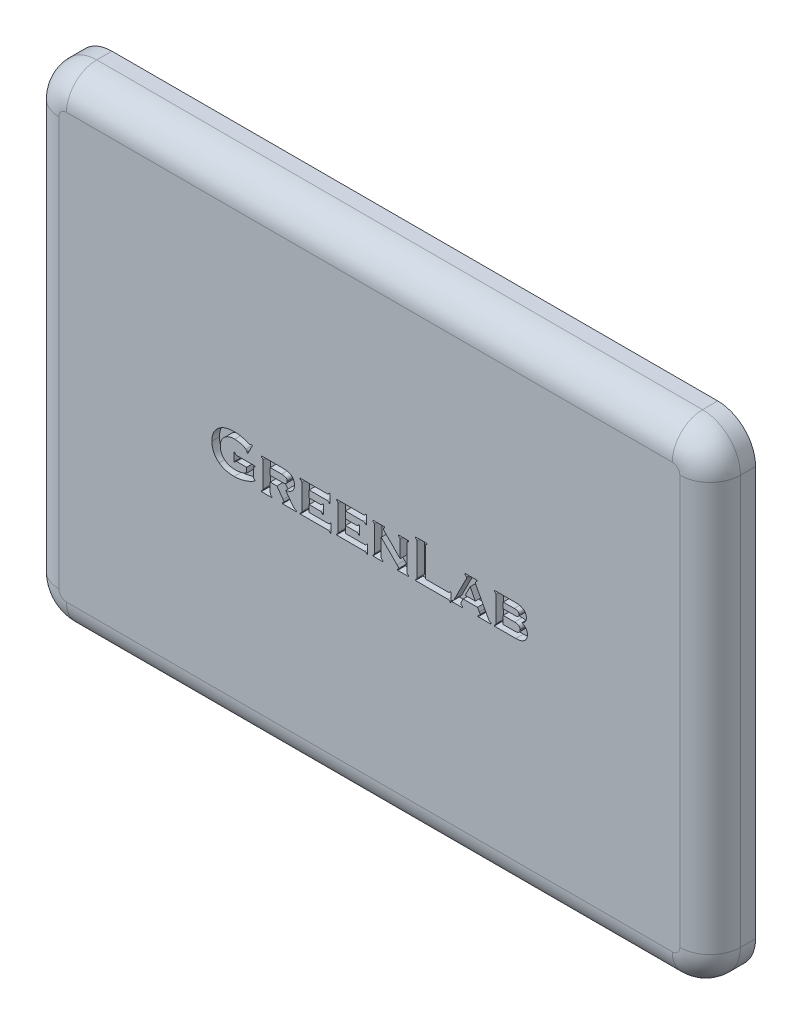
from build123d import *

# Parameters (mm, degrees)
SKETCH1_W           = 45
SKETCH1_H           = 32
BOSS_EXTRUDE1_DEPTH = 3
FILLET1_R           = 2.5
FILLET2_R           = 2
CUT_EXTRUDE1_DEPTH  = 0.5


with BuildPart() as part:
    # Sketch1 → Boss-Extrude1 (new body)
    with BuildSketch(Plane.XY.offset(3)):
        with Locations((0, -6.5)):
            Rectangle(SKETCH1_W, SKETCH1_H)
    extrude(amount=-BOSS_EXTRUDE1_DEPTH)

    # Fillet1
    fillet1_edges = [part.edges().sort_by_distance(p)[0] for p in [
        (-22.5, -22.5, 1.5),
        (-22.5, 9.5, 1.5),
        (22.5, 9.5, 1.5),
        (22.5, -22.5, 1.5),
    ]]
    fillet(fillet1_edges, radius=FILLET1_R)

    # Fillet2
    fillet2_edges = [part.edges().sort_by_distance(p)[0] for p in [
        (0, 9.5, 3),
        (0, -22.5, 3),
        (22.5, -6.5, 3),
        (-22.5, -6.5, 3),
        (21.767766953, -21.767766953, 3),
        (-21.767766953, -21.767766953, 3),
        (21.767766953, 8.767766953, 3),
        (-21.767766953, 8.767766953, 3),
    ]]
    fillet(fillet2_edges, radius=FILLET2_R)

    # Sketch2 → Cut-Extrude1 (cut)
    # profile 1 of 8: a face of its own
    with BuildSketch(Plane.XY.offset(3)):
        with BuildLine():
            Line((-8.107638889, -6.847222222), (-8.736979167, -6.847222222))
            add(Edge.make_bspline(
                [(-8.736979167, -6.847222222), (-8.746019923, -6.847634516), (-8.763102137, -6.84841353), (-8.787347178, -6.85149615), (-8.807491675, -6.859463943), (-8.824959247, -6.869292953), (-8.838890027, -6.88393915), (-8.851469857, -6.902230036), (-8.862777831, -6.925071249), (-8.86849343, -6.942262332), (-8.871527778, -6.951388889)],
                knots=[0, 0, 0, 0, 1.161951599, 2.195469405, 3.113157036, 3.92473158, 4.744880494, 5.677977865, 6.767264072, 8, 8, 8, 8], degree=3))
            Line((-8.871527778, -6.951388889), (-8.940972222, -6.951388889))
            Line((-8.940972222, -6.951388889), (-8.940972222, -6.395833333))
            Line((-8.940972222, -6.395833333), (-8.871527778, -6.395833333))
            add(Edge.make_bspline(
                [(-8.871527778, -6.395833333), (-8.868544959, -6.405168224), (-8.86297233, -6.422608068), (-8.851170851, -6.445397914), (-8.83964868, -6.46444602), (-8.825666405, -6.478851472), (-8.808569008, -6.488338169), (-8.788872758, -6.49558164), (-8.765290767, -6.498858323), (-8.74855745, -6.499604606), (-8.73969184, -6.5)],
                knots=[0, 0, 0, 0, 1.267174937, 2.367390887, 3.316236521, 4.144614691, 4.932227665, 5.829021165, 6.8497767, 8, 8, 8, 8], degree=3))
            Line((-8.73969184, -6.5), (-7.552083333, -6.5))
            Line((-7.552083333, -6.5), (-7.552083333, -6.569444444))
            add(Edge.make_bspline(
                [(-7.552083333, -6.569444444), (-7.561041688, -6.572276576), (-7.577879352, -6.577599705), (-7.600257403, -6.588767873), (-7.618962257, -6.600221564), (-7.633298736, -6.613946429), (-7.644193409, -6.629700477), (-7.650911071, -6.64859326), (-7.655417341, -6.670325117), (-7.655959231, -6.685880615), (-7.65625, -6.694227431)],
                knots=[0, 0, 0, 0, 1.261989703, 2.371971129, 3.357346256, 4.200586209, 5.023932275, 5.909634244, 6.878345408, 8, 8, 8, 8], degree=3))
            Line((-7.65625, -6.694227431), (-7.65625, -7.173828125))
            add(Edge.make_bspline(
                [(-7.65625, -7.173828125), (-7.655889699, -7.182161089), (-7.655219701, -7.197656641), (-7.651544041, -7.219691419), (-7.644732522, -7.238581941), (-7.634437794, -7.254788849), (-7.620144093, -7.26839035), (-7.601054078, -7.279314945), (-7.578418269, -7.290471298), (-7.561224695, -7.295785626), (-7.552083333, -7.298611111)],
                knots=[0, 0, 0, 0, 1.116533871, 2.076248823, 2.980572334, 3.786808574, 4.626198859, 5.59413096, 6.720864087, 8, 8, 8, 8], degree=3))
            Line((-7.552083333, -7.298611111), (-7.552083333, -7.368055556))
            add(Edge.make_bspline(
                [(-7.552083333, -7.368055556), (-7.610666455, -7.401306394), (-7.725820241, -7.466665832), (-7.902088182, -7.551148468), (-8.0768336, -7.623083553), (-8.250217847, -7.681933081), (-8.422179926, -7.72792273), (-8.592791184, -7.76040836), (-8.762157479, -7.780912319), (-8.874726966, -7.783457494), (-8.930664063, -7.784722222)],
                knots=[0, 0, 0, 0, 1.109239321, 2.180373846, 3.216973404, 4.220153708, 5.194106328, 6.146335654, 7.078892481, 8, 8, 8, 8], degree=3))
            add(Edge.make_bspline(
                [(-8.930664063, -7.784722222), (-8.980070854, -7.783992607), (-9.076548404, -7.782567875), (-9.217712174, -7.76841923), (-9.352032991, -7.746781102), (-9.479198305, -7.714926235), (-9.600077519, -7.675751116), (-9.713379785, -7.62610841), (-9.820263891, -7.568197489), (-9.885929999, -7.522231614), (-9.918619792, -7.499348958)],
                knots=[0, 0, 0, 0, 1.133031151, 2.212490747, 3.251195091, 4.25132316, 5.216867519, 6.162529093, 7.085273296, 8, 8, 8, 8], degree=3))
            add(Edge.make_bspline(
                [(-9.918619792, -7.499348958), (-9.938124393, -7.484168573), (-9.976843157, -7.454033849), (-10.031627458, -7.405928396), (-10.082161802, -7.355026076), (-10.129550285, -7.302718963), (-10.17259339, -7.247401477), (-10.211973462, -7.190094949), (-10.248171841, -7.130940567), (-10.279424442, -7.069179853), (-10.30797848, -7.005624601), (-10.332178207, -6.939559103), (-10.352729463, -6.871389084), (-10.370474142, -6.801271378), (-10.383184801, -6.728693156), (-10.392260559, -6.653891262), (-10.398679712, -6.577151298), (-10.399095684, -6.525150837), (-10.399305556, -6.498914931)],
                knots=[0, 0, 0, 0, 1.027594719, 2.039887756, 3.02889878, 4.008719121, 4.97294883, 5.940778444, 6.898978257, 7.854104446, 8.816896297, 9.794723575, 10.777166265, 11.776613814, 12.800294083, 13.838400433, 14.909403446, 16, 16, 16, 16], degree=3))
            add(Edge.make_bspline(
                [(-10.399305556, -6.498914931), (-10.398163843, -6.450375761), (-10.395933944, -6.355573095), (-10.375311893, -6.2171466), (-10.341722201, -6.08638671), (-10.295190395, -5.962858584), (-10.234124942, -5.847529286), (-10.160674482, -5.739470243), (-10.073195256, -5.639056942), (-10.005960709, -5.580025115), (-9.971788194, -5.550021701)],
                knots=[0, 0, 0, 0, 1.080618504, 2.110574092, 3.109061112, 4.08310081, 5.043468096, 6.008781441, 6.987946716, 8, 8, 8, 8], degree=3))
            add(Edge.make_bspline(
                [(-9.971788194, -5.550021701), (-9.937269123, -5.522989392), (-9.867919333, -5.468680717), (-9.752786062, -5.401429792), (-9.630135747, -5.343483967), (-9.498958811, -5.296312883), (-9.359427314, -5.260151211), (-9.211752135, -5.234311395), (-9.055798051, -5.218332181), (-8.948968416, -5.21631154), (-8.894314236, -5.215277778)],
                knots=[0, 0, 0, 0, 0.913103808, 1.834451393, 2.772129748, 3.738097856, 4.735733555, 5.773315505, 6.860825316, 8, 8, 8, 8], degree=3))
            add(Edge.make_bspline(
                [(-8.894314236, -5.215277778), (-8.859221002, -5.215887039), (-8.790049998, -5.217087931), (-8.687866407, -5.223951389), (-8.588838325, -5.236602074), (-8.491005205, -5.254165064), (-8.391504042, -5.278101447), (-8.286896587, -5.308190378), (-8.175981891, -5.345032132), (-8.100485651, -5.373601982), (-8.061523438, -5.388346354)],
                knots=[0, 0, 0, 0, 0.983904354, 1.939338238, 2.869415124, 3.781350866, 4.72455948, 5.737149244, 6.832184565, 8, 8, 8, 8], degree=3))
            add(Edge.make_bspline(
                [(-8.061523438, -5.388346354), (-8.042421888, -5.395777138), (-8.007378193, -5.409409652), (-7.958763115, -5.425251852), (-7.918882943, -5.435512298), (-7.895004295, -5.437428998), (-7.884657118, -5.438259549)],
                knots=[0, 0, 0, 0, 1.33242011, 2.444457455, 3.325947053, 4, 4, 4, 4], degree=3))
            add(Edge.make_bspline(
                [(-7.884657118, -5.438259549), (-7.87789614, -5.437670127), (-7.863399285, -5.436406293), (-7.841685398, -5.427413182), (-7.818394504, -5.414066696), (-7.803311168, -5.402311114), (-7.795138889, -5.39594184)],
                knots=[0, 0, 0, 0, 0.80452628, 1.72506123, 2.767418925, 4, 4, 4, 4], degree=3))
            Line((-7.795138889, -5.39594184), (-7.725694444, -5.423611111))
            Line((-7.725694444, -5.423611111), (-8.020833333, -6.022569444))
            Line((-8.020833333, -6.022569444), (-8.074001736, -5.994357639))
            add(Edge.make_bspline(
                [(-8.074001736, -5.994357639), (-8.074303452, -5.984749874), (-8.074858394, -5.96707845), (-8.079026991, -5.942839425), (-8.083484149, -5.922707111), (-8.090167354, -5.905501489), (-8.101350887, -5.890532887), (-8.115250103, -5.874147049), (-8.134663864, -5.85707125), (-8.149183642, -5.845454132), (-8.157009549, -5.839192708)],
                knots=[0, 0, 0, 0, 1.244331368, 2.288680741, 3.181265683, 3.916936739, 4.658188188, 5.588746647, 6.700376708, 8, 8, 8, 8], degree=3))
            add(Edge.make_bspline(
                [(-8.157009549, -5.839192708), (-8.177704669, -5.824987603), (-8.221692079, -5.794794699), (-8.298225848, -5.756470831), (-8.387995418, -5.722623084), (-8.487614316, -5.691386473), (-8.592124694, -5.665292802), (-8.696489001, -5.646244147), (-8.79800503, -5.634259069), (-8.864805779, -5.632706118), (-8.897569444, -5.631944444)],
                knots=[0, 0, 0, 0, 0.772448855, 1.64183753, 2.627606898, 3.725128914, 4.855858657, 5.942928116, 6.991070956, 8, 8, 8, 8], degree=3))
            add(Edge.make_bspline(
                [(-8.897569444, -5.631944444), (-8.929789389, -5.632493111), (-8.992775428, -5.633565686), (-9.085311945, -5.644233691), (-9.173499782, -5.661407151), (-9.257798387, -5.685338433), (-9.337574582, -5.716163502), (-9.413144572, -5.7541906), (-9.485140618, -5.798081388), (-9.528900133, -5.833445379), (-9.55078125, -5.851128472)],
                knots=[0, 0, 0, 0, 1.098368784, 2.14717621, 3.171603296, 4.15934231, 5.131674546, 6.083189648, 7.041535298, 8, 8, 8, 8], degree=3))
            add(Edge.make_bspline(
                [(-9.55078125, -5.851128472), (-9.574285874, -5.87211143), (-9.620495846, -5.91336382), (-9.679919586, -5.983944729), (-9.730560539, -6.058842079), (-9.772321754, -6.138833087), (-9.804401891, -6.223939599), (-9.82687576, -6.314078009), (-9.841700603, -6.40890706), (-9.843057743, -6.473900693), (-9.84375, -6.507052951)],
                knots=[0, 0, 0, 0, 1.016795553, 1.999014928, 2.971244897, 3.932867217, 4.907271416, 5.901990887, 6.92983762, 8, 8, 8, 8], degree=3))
            add(Edge.make_bspline(
                [(-9.84375, -6.507052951), (-9.843027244, -6.539300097), (-9.84161552, -6.602286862), (-9.827287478, -6.694381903), (-9.805662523, -6.781931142), (-9.773562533, -6.864534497), (-9.733608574, -6.942507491), (-9.683783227, -7.015299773), (-9.62613185, -7.084302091), (-9.580802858, -7.124636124), (-9.557834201, -7.145073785)],
                knots=[0, 0, 0, 0, 1.069643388, 2.089281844, 3.086639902, 4.057689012, 5.02427436, 5.988321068, 6.980662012, 8, 8, 8, 8], degree=3))
            add(Edge.make_bspline(
                [(-9.557834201, -7.145073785), (-9.535565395, -7.16289434), (-9.490831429, -7.198692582), (-9.417196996, -7.244305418), (-9.338000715, -7.282097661), (-9.254216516, -7.313760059), (-9.16521899, -7.338245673), (-9.070966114, -7.355186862), (-8.971633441, -7.366595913), (-8.903570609, -7.367562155), (-8.868815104, -7.368055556)],
                knots=[0, 0, 0, 0, 0.924808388, 1.857771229, 2.80254234, 3.768129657, 4.760342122, 5.792672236, 6.872853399, 8, 8, 8, 8], degree=3))
            add(Edge.make_bspline(
                [(-8.868815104, -7.368055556), (-8.834259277, -7.367328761), (-8.765223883, -7.365876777), (-8.661897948, -7.357261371), (-8.559468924, -7.341751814), (-8.458511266, -7.321473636), (-8.361401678, -7.295732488), (-8.269900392, -7.265568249), (-8.185549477, -7.230503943), (-8.133135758, -7.202960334), (-8.107638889, -7.189561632)],
                knots=[0, 0, 0, 0, 1.05048524, 2.098652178, 3.148964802, 4.19795309, 5.227341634, 6.200829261, 7.124785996, 8, 8, 8, 8], degree=3))
            Line((-8.107638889, -7.189561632), (-8.107638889, -6.847222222))
        make_face()
    # profile 2 of 8: a face of its own
    with BuildSketch(Plane.XY.offset(3)):
        with BuildLine():
            Line((-6.545138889, -6.916666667), (-6.545138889, -7.548177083))
            add(Edge.make_bspline(
                [(-6.545138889, -7.548177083), (-6.544839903, -7.5568801), (-6.544281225, -7.573142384), (-6.539846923, -7.595995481), (-6.532938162, -7.615684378), (-6.523033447, -7.632897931), (-6.508225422, -7.646977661), (-6.489947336, -7.659747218), (-6.467080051, -7.671315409), (-6.450096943, -7.677326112), (-6.440972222, -7.680555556)],
                knots=[0, 0, 0, 0, 1.132768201, 2.116668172, 3.018181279, 3.842213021, 4.674950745, 5.655178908, 6.740169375, 8, 8, 8, 8], degree=3))
            Line((-6.440972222, -7.680555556), (-6.440972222, -7.75))
            Line((-6.440972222, -7.75), (-7.135416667, -7.75))
            Line((-7.135416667, -7.75), (-7.135416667, -7.680555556))
            add(Edge.make_bspline(
                [(-7.135416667, -7.680555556), (-7.126472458, -7.677700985), (-7.109661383, -7.672335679), (-7.087153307, -7.661465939), (-7.068820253, -7.649034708), (-7.05447955, -7.634320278), (-7.043995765, -7.616821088), (-7.036416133, -7.59662627), (-7.032154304, -7.573126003), (-7.031564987, -7.556513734), (-7.03125, -7.547634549)],
                knots=[0, 0, 0, 0, 1.214843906, 2.283358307, 3.225537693, 4.070394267, 4.922042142, 5.848661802, 6.850119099, 8, 8, 8, 8], degree=3))
            Line((-7.03125, -7.547634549), (-7.03125, -5.90375434))
            add(Edge.make_bspline(
                [(-7.03125, -5.90375434), (-7.031680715, -5.895080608), (-7.032501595, -5.878549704), (-7.035379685, -5.85511533), (-7.04376477, -5.835706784), (-7.05327372, -5.818446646), (-7.068135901, -5.8046068), (-7.086043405, -5.791303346), (-7.109231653, -5.780258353), (-7.126318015, -5.774108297), (-7.135416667, -5.770833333)],
                knots=[0, 0, 0, 0, 1.128472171, 2.1507081, 3.035212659, 3.856119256, 4.685698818, 5.643135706, 6.74494729, 8, 8, 8, 8], degree=3))
            Line((-7.135416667, -5.770833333), (-7.135416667, -5.701388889))
            Line((-7.135416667, -5.701388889), (-5.805121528, -5.701388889))
            add(Edge.make_bspline(
                [(-5.805121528, -5.701388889), (-5.764428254, -5.701680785), (-5.688252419, -5.702227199), (-5.581604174, -5.706683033), (-5.490562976, -5.715336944), (-5.41265521, -5.726369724), (-5.344214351, -5.742592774), (-5.281290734, -5.763599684), (-5.221930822, -5.7902276), (-5.185338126, -5.812405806), (-5.167100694, -5.823459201)],
                knots=[0, 0, 0, 0, 1.48188809, 2.77402262, 3.885406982, 4.811191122, 5.637019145, 6.442966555, 7.223990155, 8, 8, 8, 8], degree=3))
            add(Edge.make_bspline(
                [(-5.167100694, -5.823459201), (-5.149512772, -5.835794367), (-5.114727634, -5.860190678), (-5.069915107, -5.905479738), (-5.032309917, -5.956473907), (-5.001059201, -6.012743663), (-4.977218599, -6.074896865), (-4.959891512, -6.142585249), (-4.949527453, -6.216114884), (-4.948464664, -6.267037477), (-4.947916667, -6.293294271)],
                knots=[0, 0, 0, 0, 0.949876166, 1.878651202, 2.806113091, 3.748939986, 4.72015234, 5.745812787, 6.837692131, 8, 8, 8, 8], degree=3))
            add(Edge.make_bspline(
                [(-4.947916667, -6.293294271), (-4.948315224, -6.313385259), (-4.949093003, -6.352592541), (-4.955673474, -6.409780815), (-4.966568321, -6.463440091), (-4.98090752, -6.514020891), (-5.000835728, -6.560657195), (-5.023983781, -6.604677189), (-5.052390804, -6.644664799), (-5.084833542, -6.681705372), (-5.122234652, -6.715345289), (-5.164203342, -6.747287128), (-5.212018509, -6.77549296), (-5.264713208, -6.801929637), (-5.322723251, -6.825390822), (-5.38582309, -6.847290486), (-5.454399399, -6.866137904), (-5.502153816, -6.876563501), (-5.526801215, -6.881944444)],
                knots=[0, 0, 0, 0, 1.054974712, 2.05876829, 3.018077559, 3.928757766, 4.81427522, 5.67693176, 6.535972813, 7.383915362, 8.257948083, 9.17356801, 10.149288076, 11.168732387, 12.267602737, 13.433048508, 14.67512408, 16, 16, 16, 16], degree=3))
            Line((-5.526801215, -6.881944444), (-5.129665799, -7.417426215))
            add(Edge.make_bspline(
                [(-5.129665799, -7.417426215), (-5.112699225, -7.439841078), (-5.081321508, -7.481294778), (-5.035022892, -7.536046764), (-4.995152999, -7.58021234), (-4.958813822, -7.613682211), (-4.92381081, -7.639052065), (-4.887236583, -7.657179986), (-4.849391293, -7.672659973), (-4.82253571, -7.677913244), (-4.809027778, -7.680555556)],
                knots=[0, 0, 0, 0, 1.583031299, 2.927633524, 4.037651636, 4.931799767, 5.706188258, 6.462410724, 7.226616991, 8, 8, 8, 8], degree=3))
            Line((-4.809027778, -7.680555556), (-4.809027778, -7.75))
            Line((-4.809027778, -7.75), (-5.734049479, -7.75))
            Line((-5.734049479, -7.75), (-5.734049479, -7.680555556))
            add(Edge.make_bspline(
                [(-5.734049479, -7.680555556), (-5.719265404, -7.67654565), (-5.69281664, -7.669371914), (-5.661254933, -7.650741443), (-5.63815299, -7.628847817), (-5.63586342, -7.610258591), (-5.634765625, -7.601345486)],
                knots=[0, 0, 0, 0, 1.339679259, 2.396691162, 3.231250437, 4, 4, 4, 4], degree=3))
            add(Edge.make_bspline(
                [(-5.634765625, -7.601345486), (-5.635664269, -7.593828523), (-5.637743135, -7.576439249), (-5.65144713, -7.549381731), (-5.670939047, -7.517140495), (-5.688186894, -7.495183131), (-5.697699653, -7.483072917)],
                knots=[0, 0, 0, 0, 0.664601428, 1.537447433, 2.641820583, 4, 4, 4, 4], degree=3))
            Line((-5.697699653, -7.483072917), (-6.106228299, -6.916666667))
            Line((-6.106228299, -6.916666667), (-6.545138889, -6.916666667))
        make_face()
        with BuildLine():
            Line((-6.545138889, -6.534722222), (-5.799696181, -6.534722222))
            add(Edge.make_bspline(
                [(-5.799696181, -6.534722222), (-5.773260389, -6.53447032), (-5.723897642, -6.533999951), (-5.65548393, -6.526461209), (-5.597284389, -6.517240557), (-5.563741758, -6.504639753), (-5.548502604, -6.498914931)],
                knots=[0, 0, 0, 0, 1.241949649, 2.3190547, 3.236309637, 4, 4, 4, 4], degree=3))
            add(Edge.make_bspline(
                [(-5.548502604, -6.498914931), (-5.539491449, -6.494653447), (-5.521891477, -6.486330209), (-5.498474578, -6.469681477), (-5.477598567, -6.450847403), (-5.462300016, -6.427469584), (-5.449364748, -6.402102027), (-5.44027173, -6.373740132), (-5.43471992, -6.342340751), (-5.434265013, -6.320445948), (-5.434027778, -6.309027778)],
                knots=[0, 0, 0, 0, 1.008207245, 1.969161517, 2.902631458, 3.838078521, 4.780680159, 5.783374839, 6.844026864, 8, 8, 8, 8], degree=3))
            add(Edge.make_bspline(
                [(-5.434027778, -6.309027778), (-5.434749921, -6.289371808), (-5.436100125, -6.252620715), (-5.451519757, -6.202232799), (-5.476937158, -6.160909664), (-5.507998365, -6.136021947), (-5.536935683, -6.120463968), (-5.563166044, -6.110833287), (-5.592860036, -6.102167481), (-5.626793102, -6.095208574), (-5.664490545, -6.089913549), (-5.706152, -6.086348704), (-5.751547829, -6.083296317), (-5.783233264, -6.083320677), (-5.799696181, -6.083333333)],
                knots=[0, 0, 0, 0, 1.425592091, 2.665453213, 3.789359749, 4.900959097, 5.513024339, 6.175067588, 6.928547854, 7.761851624, 8.692003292, 9.695964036, 10.802883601, 12, 12, 12, 12], degree=3))
            Line((-5.799696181, -6.083333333), (-6.545138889, -6.083333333))
            Line((-6.545138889, -6.083333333), (-6.545138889, -6.534722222))
        make_face(mode=Mode.SUBTRACT)
    # profile 3 of 8: a face of its own
    with BuildSketch(Plane.XY.offset(3)):
        with BuildLine():
            Line((-3.975694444, -6.916666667), (-3.975694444, -7.368055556))
            Line((-3.975694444, -7.368055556), (-2.717556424, -7.368055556))
            add(Edge.make_bspline(
                [(-2.717556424, -7.368055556), (-2.708863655, -7.367687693), (-2.692653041, -7.367001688), (-2.669706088, -7.363422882), (-2.650103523, -7.356551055), (-2.633319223, -7.346130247), (-2.618700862, -7.332059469), (-2.606449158, -7.313190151), (-2.59565496, -7.290085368), (-2.589883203, -7.272999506), (-2.586805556, -7.263888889)],
                knots=[0, 0, 0, 0, 1.135380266, 2.11730133, 3.020893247, 3.826673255, 4.678188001, 5.647254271, 6.745456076, 8, 8, 8, 8], degree=3))
            Line((-2.586805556, -7.263888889), (-2.517361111, -7.263888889))
            Line((-2.517361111, -7.263888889), (-2.517361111, -7.854166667))
            Line((-2.517361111, -7.854166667), (-2.586805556, -7.854166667))
            add(Edge.make_bspline(
                [(-2.586805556, -7.854166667), (-2.589434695, -7.845206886), (-2.594390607, -7.828317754), (-2.605383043, -7.805919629), (-2.617763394, -7.787544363), (-2.632437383, -7.773417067), (-2.649532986, -7.762584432), (-2.669669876, -7.755198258), (-2.69296558, -7.750928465), (-2.709399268, -7.75032138), (-2.718098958, -7.75)],
                knots=[0, 0, 0, 0, 1.215074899, 2.290408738, 3.23860127, 4.08884986, 4.925925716, 5.858459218, 6.866307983, 8, 8, 8, 8], degree=3))
            Line((-2.718098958, -7.75), (-4.565972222, -7.75))
            Line((-4.565972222, -7.75), (-4.565972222, -7.680555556))
            add(Edge.make_bspline(
                [(-4.565972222, -7.680555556), (-4.557028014, -7.677700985), (-4.540216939, -7.672335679), (-4.517708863, -7.661465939), (-4.499375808, -7.649034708), (-4.485035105, -7.634320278), (-4.474551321, -7.616821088), (-4.466971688, -7.59662627), (-4.46270986, -7.573126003), (-4.462120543, -7.556513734), (-4.461805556, -7.547634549)],
                knots=[0, 0, 0, 0, 1.214843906, 2.283358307, 3.225537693, 4.070394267, 4.922042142, 5.848661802, 6.850119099, 8, 8, 8, 8], degree=3))
            Line((-4.461805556, -7.547634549), (-4.461805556, -5.90375434))
            add(Edge.make_bspline(
                [(-4.461805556, -5.90375434), (-4.46223627, -5.895080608), (-4.463057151, -5.878549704), (-4.46593524, -5.85511533), (-4.474320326, -5.835706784), (-4.483829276, -5.818446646), (-4.498691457, -5.8046068), (-4.516598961, -5.791303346), (-4.539787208, -5.780258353), (-4.556873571, -5.774108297), (-4.565972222, -5.770833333)],
                knots=[0, 0, 0, 0, 1.128472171, 2.1507081, 3.035212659, 3.856119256, 4.685698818, 5.643135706, 6.74494729, 8, 8, 8, 8], degree=3))
            Line((-4.565972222, -5.770833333), (-4.565972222, -5.701388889))
            Line((-4.565972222, -5.701388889), (-2.788085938, -5.701388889))
            add(Edge.make_bspline(
                [(-2.788085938, -5.701388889), (-2.779203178, -5.701084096), (-2.762584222, -5.700513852), (-2.739357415, -5.696169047), (-2.719458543, -5.689217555), (-2.702290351, -5.67909981), (-2.687598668, -5.664835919), (-2.675521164, -5.646087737), (-2.664328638, -5.62339901), (-2.659070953, -5.606362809), (-2.65625, -5.597222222)],
                knots=[0, 0, 0, 0, 1.152879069, 2.156947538, 3.05581166, 3.877422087, 4.724481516, 5.688477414, 6.75977783, 8, 8, 8, 8], degree=3))
            Line((-2.65625, -5.597222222), (-2.586805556, -5.597222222))
            Line((-2.586805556, -5.597222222), (-2.586805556, -6.1875))
            Line((-2.586805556, -6.1875), (-2.65625, -6.1875))
            add(Edge.make_bspline(
                [(-2.65625, -6.1875), (-2.659115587, -6.178383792), (-2.664505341, -6.161237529), (-2.675190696, -6.138250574), (-2.687799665, -6.119857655), (-2.702246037, -6.105541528), (-2.719460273, -6.095813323), (-2.738915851, -6.087474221), (-2.762335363, -6.084581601), (-2.7788685, -6.083762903), (-2.787543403, -6.083333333)],
                knots=[0, 0, 0, 0, 1.242738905, 2.33741155, 3.283964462, 4.132742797, 4.956020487, 5.843079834, 6.86826837, 8, 8, 8, 8], degree=3))
            Line((-2.787543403, -6.083333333), (-3.975694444, -6.083333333))
            Line((-3.975694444, -6.083333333), (-3.975694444, -6.534722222))
            Line((-3.975694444, -6.534722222), (-3.238389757, -6.534722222))
            add(Edge.make_bspline(
                [(-3.238389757, -6.534722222), (-3.229868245, -6.534409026), (-3.213788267, -6.53381803), (-3.191283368, -6.529499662), (-3.1718834, -6.522577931), (-3.155244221, -6.512251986), (-3.140581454, -6.498202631), (-3.128587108, -6.479294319), (-3.116820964, -6.456708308), (-3.110848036, -6.439695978), (-3.107638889, -6.430555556)],
                knots=[0, 0, 0, 0, 1.117968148, 2.109590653, 2.995889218, 3.806125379, 4.662349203, 5.636774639, 6.730281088, 8, 8, 8, 8], degree=3))
            Line((-3.107638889, -6.430555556), (-3.038194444, -6.430555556))
            Line((-3.038194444, -6.430555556), (-3.038194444, -7.020833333))
            Line((-3.038194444, -7.020833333), (-3.107638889, -7.020833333))
            add(Edge.make_bspline(
                [(-3.107638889, -7.020833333), (-3.110484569, -7.011883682), (-3.115833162, -6.995062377), (-3.126878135, -6.972486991), (-3.138996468, -6.953937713), (-3.153303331, -6.939395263), (-3.170023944, -6.928894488), (-3.189983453, -6.921727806), (-3.213085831, -6.917643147), (-3.229692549, -6.917002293), (-3.238389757, -6.916666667)],
                knots=[0, 0, 0, 0, 1.225527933, 2.303439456, 3.273384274, 4.108798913, 4.947881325, 5.830104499, 6.863590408, 8, 8, 8, 8], degree=3))
            Line((-3.238389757, -6.916666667), (-3.975694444, -6.916666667))
        make_face()
    # profile 4 of 8: a face of its own
    with BuildSketch(Plane.XY.offset(3)):
        with BuildLine():
            Line((-1.579861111, -6.916666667), (-1.579861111, -7.368055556))
            Line((-1.579861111, -7.368055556), (-0.32172309, -7.368055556))
            add(Edge.make_bspline(
                [(-0.32172309, -7.368055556), (-0.313030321, -7.367687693), (-0.296819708, -7.367001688), (-0.273872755, -7.363422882), (-0.25427019, -7.356551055), (-0.23748589, -7.346130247), (-0.222867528, -7.332059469), (-0.210615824, -7.313190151), (-0.199821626, -7.290085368), (-0.19404987, -7.272999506), (-0.190972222, -7.263888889)],
                knots=[0, 0, 0, 0, 1.135380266, 2.11730133, 3.020893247, 3.826673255, 4.678188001, 5.647254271, 6.745456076, 8, 8, 8, 8], degree=3))
            Line((-0.190972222, -7.263888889), (-0.121527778, -7.263888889))
            Line((-0.121527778, -7.263888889), (-0.121527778, -7.854166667))
            Line((-0.121527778, -7.854166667), (-0.190972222, -7.854166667))
            add(Edge.make_bspline(
                [(-0.190972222, -7.854166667), (-0.193601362, -7.845206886), (-0.198557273, -7.828317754), (-0.20954971, -7.805919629), (-0.22193006, -7.787544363), (-0.23660405, -7.773417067), (-0.253699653, -7.762584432), (-0.273836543, -7.755198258), (-0.297132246, -7.750928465), (-0.313565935, -7.75032138), (-0.322265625, -7.75)],
                knots=[0, 0, 0, 0, 1.215074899, 2.290408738, 3.23860127, 4.08884986, 4.925925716, 5.858459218, 6.866307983, 8, 8, 8, 8], degree=3))
            Line((-0.322265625, -7.75), (-2.170138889, -7.75))
            Line((-2.170138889, -7.75), (-2.170138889, -7.680555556))
            add(Edge.make_bspline(
                [(-2.170138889, -7.680555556), (-2.161194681, -7.677700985), (-2.144383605, -7.672335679), (-2.121875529, -7.661465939), (-2.103542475, -7.649034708), (-2.089201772, -7.634320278), (-2.078717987, -7.616821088), (-2.071138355, -7.59662627), (-2.066876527, -7.573126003), (-2.06628721, -7.556513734), (-2.065972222, -7.547634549)],
                knots=[0, 0, 0, 0, 1.214843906, 2.283358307, 3.225537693, 4.070394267, 4.922042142, 5.848661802, 6.850119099, 8, 8, 8, 8], degree=3))
            Line((-2.065972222, -7.547634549), (-2.065972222, -5.90375434))
            add(Edge.make_bspline(
                [(-2.065972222, -5.90375434), (-2.066402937, -5.895080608), (-2.067223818, -5.878549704), (-2.070101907, -5.85511533), (-2.078486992, -5.835706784), (-2.087995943, -5.818446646), (-2.102858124, -5.8046068), (-2.120765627, -5.791303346), (-2.143953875, -5.780258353), (-2.161040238, -5.774108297), (-2.170138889, -5.770833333)],
                knots=[0, 0, 0, 0, 1.128472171, 2.1507081, 3.035212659, 3.856119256, 4.685698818, 5.643135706, 6.74494729, 8, 8, 8, 8], degree=3))
            Line((-2.170138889, -5.770833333), (-2.170138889, -5.701388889))
            Line((-2.170138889, -5.701388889), (-0.392252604, -5.701388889))
            add(Edge.make_bspline(
                [(-0.392252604, -5.701388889), (-0.383369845, -5.701084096), (-0.366750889, -5.700513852), (-0.343524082, -5.696169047), (-0.32362521, -5.689217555), (-0.306457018, -5.67909981), (-0.291765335, -5.664835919), (-0.279687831, -5.646087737), (-0.268495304, -5.62339901), (-0.26323762, -5.606362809), (-0.260416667, -5.597222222)],
                knots=[0, 0, 0, 0, 1.152879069, 2.156947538, 3.05581166, 3.877422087, 4.724481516, 5.688477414, 6.75977783, 8, 8, 8, 8], degree=3))
            Line((-0.260416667, -5.597222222), (-0.190972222, -5.597222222))
            Line((-0.190972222, -5.597222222), (-0.190972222, -6.1875))
            Line((-0.190972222, -6.1875), (-0.260416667, -6.1875))
            add(Edge.make_bspline(
                [(-0.260416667, -6.1875), (-0.263282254, -6.178383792), (-0.268672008, -6.161237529), (-0.279357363, -6.138250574), (-0.291966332, -6.119857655), (-0.306412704, -6.105541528), (-0.323626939, -6.095813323), (-0.343082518, -6.087474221), (-0.36650203, -6.084581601), (-0.383035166, -6.083762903), (-0.391710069, -6.083333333)],
                knots=[0, 0, 0, 0, 1.242738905, 2.33741155, 3.283964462, 4.132742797, 4.956020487, 5.843079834, 6.86826837, 8, 8, 8, 8], degree=3))
            Line((-0.391710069, -6.083333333), (-1.579861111, -6.083333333))
            Line((-1.579861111, -6.083333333), (-1.579861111, -6.534722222))
            Line((-1.579861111, -6.534722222), (-0.842556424, -6.534722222))
            add(Edge.make_bspline(
                [(-0.842556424, -6.534722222), (-0.834034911, -6.534409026), (-0.817954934, -6.53381803), (-0.795450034, -6.529499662), (-0.776050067, -6.522577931), (-0.759410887, -6.512251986), (-0.744748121, -6.498202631), (-0.732753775, -6.479294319), (-0.720987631, -6.456708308), (-0.715014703, -6.439695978), (-0.711805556, -6.430555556)],
                knots=[0, 0, 0, 0, 1.117968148, 2.109590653, 2.995889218, 3.806125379, 4.662349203, 5.636774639, 6.730281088, 8, 8, 8, 8], degree=3))
            Line((-0.711805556, -6.430555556), (-0.642361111, -6.430555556))
            Line((-0.642361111, -6.430555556), (-0.642361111, -7.020833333))
            Line((-0.642361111, -7.020833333), (-0.711805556, -7.020833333))
            add(Edge.make_bspline(
                [(-0.711805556, -7.020833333), (-0.714651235, -7.011883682), (-0.719999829, -6.995062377), (-0.731044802, -6.972486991), (-0.743163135, -6.953937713), (-0.757469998, -6.939395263), (-0.774190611, -6.928894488), (-0.79415012, -6.921727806), (-0.817252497, -6.917643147), (-0.833859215, -6.917002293), (-0.842556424, -6.916666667)],
                knots=[0, 0, 0, 0, 1.225527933, 2.303439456, 3.273384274, 4.108798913, 4.947881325, 5.830104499, 6.863590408, 8, 8, 8, 8], degree=3))
            Line((-0.842556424, -6.916666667), (-1.579861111, -6.916666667))
        make_face()
    # profile 5 of 8: a face of its own
    with BuildSketch(Plane.XY.offset(3)):
        with BuildLine():
            Line((0.78125, -6.406141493), (0.78125, -7.546006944))
            add(Edge.make_bspline(
                [(0.78125, -7.546006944), (0.781544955, -7.554893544), (0.782096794, -7.571519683), (0.786594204, -7.594867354), (0.793319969, -7.615310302), (0.804126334, -7.632883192), (0.818597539, -7.647818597), (0.837278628, -7.660319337), (0.859595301, -7.671849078), (0.876458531, -7.677535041), (0.885416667, -7.680555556)],
                knots=[0, 0, 0, 0, 1.143670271, 2.139718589, 3.053348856, 3.900396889, 4.773630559, 5.710721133, 6.783882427, 8, 8, 8, 8], degree=3))
            Line((0.885416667, -7.680555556), (0.885416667, -7.75))
            Line((0.885416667, -7.75), (0.225694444, -7.75))
            Line((0.225694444, -7.75), (0.225694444, -7.680555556))
            add(Edge.make_bspline(
                [(0.225694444, -7.680555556), (0.234638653, -7.677700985), (0.251449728, -7.672335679), (0.273957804, -7.661465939), (0.292290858, -7.649034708), (0.306631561, -7.634320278), (0.317115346, -7.616821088), (0.324694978, -7.59662627), (0.328956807, -7.573126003), (0.329546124, -7.556513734), (0.329861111, -7.547634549)],
                knots=[0, 0, 0, 0, 1.214843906, 2.283358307, 3.225537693, 4.070394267, 4.922042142, 5.848661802, 6.850119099, 8, 8, 8, 8], degree=3))
            Line((0.329861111, -7.547634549), (0.329861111, -5.90375434))
            add(Edge.make_bspline(
                [(0.329861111, -5.90375434), (0.329430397, -5.895080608), (0.328609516, -5.878549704), (0.325731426, -5.85511533), (0.317346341, -5.835706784), (0.307837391, -5.818446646), (0.29297521, -5.8046068), (0.275067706, -5.791303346), (0.251879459, -5.780258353), (0.234793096, -5.774108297), (0.225694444, -5.770833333)],
                knots=[0, 0, 0, 0, 1.128472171, 2.1507081, 3.035212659, 3.856119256, 4.685698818, 5.643135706, 6.74494729, 8, 8, 8, 8], degree=3))
            Line((0.225694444, -5.770833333), (0.225694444, -5.701388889))
            Line((0.225694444, -5.701388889), (0.996636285, -5.701388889))
            Line((0.996636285, -5.701388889), (0.996636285, -5.770833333))
            add(Edge.make_bspline(
                [(0.996636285, -5.770833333), (0.984845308, -5.774290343), (0.963820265, -5.780454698), (0.937700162, -5.7958043), (0.920119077, -5.816334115), (0.918312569, -5.832760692), (0.917426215, -5.840820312)],
                knots=[0, 0, 0, 0, 1.287745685, 2.296239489, 3.164058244, 4, 4, 4, 4], degree=3))
            add(Edge.make_bspline(
                [(0.917426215, -5.840820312), (0.918315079, -5.848335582), (0.920256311, -5.864748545), (0.93229719, -5.889323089), (0.950467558, -5.915547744), (0.966344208, -5.932186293), (0.974934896, -5.941189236)],
                knots=[0, 0, 0, 0, 0.763994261, 1.668524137, 2.738463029, 4, 4, 4, 4], degree=3))
            Line((0.974934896, -5.941189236), (2.03125, -7.011067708))
            Line((2.03125, -7.011067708), (2.03125, -5.90375434))
            add(Edge.make_bspline(
                [(2.03125, -5.90375434), (2.030829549, -5.895076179), (2.030028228, -5.878536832), (2.026998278, -5.85499054), (2.01890068, -5.835263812), (2.009048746, -5.817889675), (1.994569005, -5.803515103), (1.976542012, -5.790187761), (1.953219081, -5.779765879), (1.936172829, -5.773939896), (1.927083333, -5.770833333)],
                knots=[0, 0, 0, 0, 1.125637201, 2.145305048, 3.049360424, 3.868204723, 4.712412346, 5.667443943, 6.756221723, 8, 8, 8, 8], degree=3))
            Line((1.927083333, -5.770833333), (1.927083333, -5.701388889))
            Line((1.927083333, -5.701388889), (2.586805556, -5.701388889))
            Line((2.586805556, -5.701388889), (2.586805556, -5.770833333))
            add(Edge.make_bspline(
                [(2.586805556, -5.770833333), (2.57769139, -5.77389526), (2.560753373, -5.779585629), (2.537736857, -5.790520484), (2.5193493, -5.803317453), (2.504906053, -5.817928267), (2.494821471, -5.835136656), (2.487774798, -5.855187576), (2.483602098, -5.87844821), (2.482969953, -5.895056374), (2.482638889, -5.90375434)],
                knots=[0, 0, 0, 0, 1.244751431, 2.313280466, 3.288100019, 4.132968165, 4.952453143, 5.848991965, 6.873482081, 8, 8, 8, 8], degree=3))
            Line((2.482638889, -5.90375434), (2.482638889, -7.546006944))
            add(Edge.make_bspline(
                [(2.482638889, -7.546006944), (2.482973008, -7.554703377), (2.483610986, -7.571308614), (2.487744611, -7.594588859), (2.494968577, -7.61472442), (2.504745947, -7.632265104), (2.519189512, -7.647071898), (2.538193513, -7.658984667), (2.560488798, -7.671512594), (2.577635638, -7.67740459), (2.586805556, -7.680555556)],
                knots=[0, 0, 0, 0, 1.1214246, 2.141282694, 3.033768, 3.869628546, 4.710676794, 5.667831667, 6.752785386, 8, 8, 8, 8], degree=3))
            Line((2.586805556, -7.680555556), (2.586805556, -7.75))
            Line((2.586805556, -7.75), (1.868489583, -7.75))
            Line((1.868489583, -7.75), (1.868489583, -7.680555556))
            add(Edge.make_bspline(
                [(1.868489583, -7.680555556), (1.880040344, -7.677588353), (1.900866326, -7.672238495), (1.927214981, -7.658685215), (1.944467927, -7.638616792), (1.946263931, -7.6227832), (1.947157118, -7.614908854)],
                knots=[0, 0, 0, 0, 1.28387963, 2.314830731, 3.161933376, 4, 4, 4, 4], degree=3))
            add(Edge.make_bspline(
                [(1.947157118, -7.614908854), (1.945977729, -7.606177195), (1.943409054, -7.587159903), (1.927434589, -7.5653674), (1.909411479, -7.544070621), (1.888236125, -7.521008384), (1.860370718, -7.491393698), (1.839075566, -7.469993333), (1.827256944, -7.458116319)],
                knots=[0, 0, 0, 0, 0.779058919, 1.696767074, 2.352735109, 3.293916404, 4.498147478, 6, 6, 6, 6], degree=3))
            Line((1.827256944, -7.458116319), (0.78125, -6.406141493))
        make_face()
    # profile 6 of 8: a face of its own
    with BuildSketch(Plane.XY.offset(3)):
        with BuildLine():
            Line((3.697916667, -7.333333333), (5.199110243, -7.333333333))
            add(Edge.make_bspline(
                [(5.199110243, -7.333333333), (5.207807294, -7.333008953), (5.224235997, -7.332396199), (5.247167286, -7.328236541), (5.266753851, -7.320996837), (5.283813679, -7.311225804), (5.29792818, -7.296557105), (5.3101063, -7.278076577), (5.321143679, -7.255239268), (5.326811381, -7.238287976), (5.329861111, -7.229166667)],
                knots=[0, 0, 0, 0, 1.13718709, 2.148142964, 3.030969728, 3.85821599, 4.694202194, 5.66481062, 6.743459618, 8, 8, 8, 8], degree=3))
            Line((5.329861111, -7.229166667), (5.399305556, -7.229166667))
            Line((5.399305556, -7.229166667), (5.399305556, -7.854166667))
            Line((5.399305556, -7.854166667), (5.329861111, -7.854166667))
            add(Edge.make_bspline(
                [(5.329861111, -7.854166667), (5.326766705, -7.845069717), (5.320963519, -7.828009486), (5.31043664, -7.804873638), (5.297733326, -7.786739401), (5.283852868, -7.772040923), (5.266621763, -7.762509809), (5.247204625, -7.754131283), (5.223772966, -7.751251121), (5.207241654, -7.750430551), (5.198567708, -7.75)],
                knots=[0, 0, 0, 0, 1.251925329, 2.347834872, 3.295457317, 4.12837309, 4.952581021, 5.840642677, 6.866989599, 8, 8, 8, 8], degree=3))
            Line((5.198567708, -7.75), (3.038194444, -7.75))
            Line((3.038194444, -7.75), (3.038194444, -7.680555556))
            add(Edge.make_bspline(
                [(3.038194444, -7.680555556), (3.047291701, -7.677461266), (3.064352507, -7.671658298), (3.087484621, -7.661130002), (3.105630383, -7.64843106), (3.120292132, -7.63453667), (3.130125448, -7.617060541), (3.137923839, -7.597248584), (3.141240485, -7.573593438), (3.141970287, -7.557041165), (3.142361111, -7.548177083)],
                knots=[0, 0, 0, 0, 1.245049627, 2.334940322, 3.277358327, 4.105699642, 4.925380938, 5.852235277, 6.849827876, 8, 8, 8, 8], degree=3))
            Line((3.142361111, -7.548177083), (3.142361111, -5.451822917))
            add(Edge.make_bspline(
                [(3.142361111, -5.451822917), (3.141962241, -5.442961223), (3.141217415, -5.426413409), (3.138022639, -5.402897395), (3.130021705, -5.383323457), (3.120138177, -5.365987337), (3.105839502, -5.351540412), (3.087450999, -5.338903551), (3.0643629, -5.32833133), (3.047295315, -5.322535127), (3.038194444, -5.319444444)],
                knots=[0, 0, 0, 0, 1.150912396, 2.149147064, 3.054708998, 3.874917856, 4.720532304, 5.663556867, 6.754149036, 8, 8, 8, 8], degree=3))
            Line((3.038194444, -5.319444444), (3.038194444, -5.25))
            Line((3.038194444, -5.25), (3.802083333, -5.25))
            Line((3.802083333, -5.25), (3.802083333, -5.319444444))
            add(Edge.make_bspline(
                [(3.802083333, -5.319444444), (3.792984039, -5.322343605), (3.776098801, -5.327723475), (3.752882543, -5.337966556), (3.734664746, -5.350883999), (3.719992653, -5.365514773), (3.710255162, -5.38311974), (3.70301995, -5.403236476), (3.698856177, -5.426701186), (3.698241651, -5.443487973), (3.697916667, -5.452365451)],
                knots=[0, 0, 0, 0, 1.233044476, 2.288117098, 3.259808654, 4.10196579, 4.938928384, 5.832590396, 6.853793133, 8, 8, 8, 8], degree=3))
            Line((3.697916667, -5.452365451), (3.697916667, -7.333333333))
        make_face()
    # profile 7 of 8: a face of its own
    with BuildSketch(Plane.XY.offset(3)):
        with BuildLine():
            Line((7.139756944, -7.229166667), (6.189778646, -7.229166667))
            Line((6.189778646, -7.229166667), (6.076388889, -7.44780816))
            add(Edge.make_bspline(
                [(6.076388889, -7.44780816), (6.070577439, -7.460204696), (6.059856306, -7.48307419), (6.047782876, -7.516254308), (6.039301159, -7.545039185), (6.038311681, -7.563324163), (6.037868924, -7.571506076)],
                knots=[0, 0, 0, 0, 1.258043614, 2.320875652, 3.2486483, 4, 4, 4, 4], degree=3))
            add(Edge.make_bspline(
                [(6.037868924, -7.571506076), (6.038350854, -7.578408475), (6.039279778, -7.591712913), (6.044619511, -7.6108393), (6.05490056, -7.627715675), (6.069394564, -7.642105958), (6.086870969, -7.655732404), (6.109203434, -7.665505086), (6.134769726, -7.674324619), (6.153372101, -7.678402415), (6.163194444, -7.680555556)],
                knots=[0, 0, 0, 0, 0.910861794, 1.755694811, 2.589696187, 3.483236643, 4.43677035, 5.49240796, 6.675952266, 8, 8, 8, 8], degree=3))
            Line((6.163194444, -7.680555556), (6.163194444, -7.75))
            Line((6.163194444, -7.75), (5.434027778, -7.75))
            Line((5.434027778, -7.75), (5.434027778, -7.680555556))
            add(Edge.make_bspline(
                [(5.434027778, -7.680555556), (5.444933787, -7.678634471), (5.465760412, -7.674965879), (5.49426339, -7.665954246), (5.518478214, -7.654375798), (5.539311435, -7.639559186), (5.557979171, -7.618869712), (5.577231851, -7.592229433), (5.597843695, -7.558174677), (5.611225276, -7.532706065), (5.618489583, -7.518880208)],
                knots=[0, 0, 0, 0, 1.026027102, 1.959349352, 2.761782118, 3.5064187, 4.313045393, 5.332612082, 6.551985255, 8, 8, 8, 8], degree=3))
            Line((5.618489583, -7.518880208), (6.372612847, -6.032877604))
            add(Edge.make_bspline(
                [(6.372612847, -6.032877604), (6.378969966, -6.0194069), (6.391065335, -5.993776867), (6.405131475, -5.955670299), (6.412936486, -5.919805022), (6.414291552, -5.896731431), (6.414930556, -5.885850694)],
                knots=[0, 0, 0, 0, 1.158371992, 2.203976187, 3.153055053, 4, 4, 4, 4], degree=3))
            add(Edge.make_bspline(
                [(6.414930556, -5.885850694), (6.413638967, -5.874008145), (6.411020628, -5.850000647), (6.389677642, -5.817156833), (6.355350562, -5.790572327), (6.327205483, -5.777801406), (6.311848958, -5.770833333)],
                knots=[0, 0, 0, 0, 0.861054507, 1.745550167, 2.769926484, 4, 4, 4, 4], degree=3))
            Line((6.311848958, -5.770833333), (6.311848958, -5.701388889))
            Line((6.311848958, -5.701388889), (7.109375, -5.701388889))
            Line((7.109375, -5.701388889), (7.109375, -5.770833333))
            add(Edge.make_bspline(
                [(7.109375, -5.770833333), (7.094246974, -5.777453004), (7.066138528, -5.789752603), (7.033348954, -5.81884635), (7.012023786, -5.853838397), (7.009659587, -5.879779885), (7.008463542, -5.892903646)],
                knots=[0, 0, 0, 0, 1.167592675, 2.169431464, 3.073918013, 4, 4, 4, 4], degree=3))
            add(Edge.make_bspline(
                [(7.008463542, -5.892903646), (7.008991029, -5.903451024), (7.010107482, -5.92577506), (7.020079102, -5.960532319), (7.033691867, -5.998937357), (7.047007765, -6.024702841), (7.054036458, -6.038302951)],
                knots=[0, 0, 0, 0, 0.821800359, 1.739380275, 2.806749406, 4, 4, 4, 4], degree=3))
            Line((7.054036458, -6.038302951), (7.826605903, -7.479275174))
            add(Edge.make_bspline(
                [(7.826605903, -7.479275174), (7.836633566, -7.497232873), (7.854932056, -7.530002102), (7.881087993, -7.573693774), (7.904536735, -7.606669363), (7.925317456, -7.631422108), (7.947707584, -7.649353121), (7.973996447, -7.661725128), (8.003973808, -7.673871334), (8.026322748, -7.67823669), (8.038194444, -7.680555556)],
                knots=[0, 0, 0, 0, 1.613020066, 2.94344076, 3.990283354, 4.784068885, 5.470665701, 6.219068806, 7.053974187, 8, 8, 8, 8], degree=3))
            Line((8.038194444, -7.680555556), (8.038194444, -7.75))
            Line((8.038194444, -7.75), (7.1875, -7.75))
            Line((7.1875, -7.75), (7.1875, -7.680555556))
            add(Edge.make_bspline(
                [(7.1875, -7.680555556), (7.196778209, -7.678789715), (7.21432341, -7.67545049), (7.238424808, -7.667295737), (7.258902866, -7.657095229), (7.27554808, -7.644306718), (7.28914655, -7.629502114), (7.298221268, -7.611857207), (7.304003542, -7.592303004), (7.304454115, -7.578602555), (7.3046875, -7.571506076)],
                knots=[0, 0, 0, 0, 1.280586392, 2.42160363, 3.442514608, 4.370371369, 5.257057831, 6.146457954, 7.039913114, 8, 8, 8, 8], degree=3))
            add(Edge.make_bspline(
                [(7.3046875, -7.571506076), (7.304129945, -7.561686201), (7.302933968, -7.540622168), (7.293238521, -7.507691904), (7.278677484, -7.471554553), (7.26552331, -7.447144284), (7.258572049, -7.434244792)],
                knots=[0, 0, 0, 0, 0.804870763, 1.726480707, 2.798569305, 4, 4, 4, 4], degree=3))
            Line((7.258572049, -7.434244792), (7.139756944, -7.229166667))
        make_face()
        Polygon((6.994357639, -6.951388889), (6.655815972, -6.296006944), (6.329210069, -6.951388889), align=None, mode=Mode.SUBTRACT)
    # profile 8 of 8: a face of its own
    with BuildSketch(Plane.XY.offset(3)):
        with BuildLine():
            add(Edge.make_bspline(
                [(10.073784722, -6.649739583), (10.097643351, -6.660989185), (10.142611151, -6.68219199), (10.203527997, -6.716984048), (10.254862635, -6.751276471), (10.283442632, -6.776751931), (10.296766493, -6.788628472)],
                knots=[0, 0, 0, 0, 1.199284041, 2.260363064, 3.188989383, 4, 4, 4, 4], degree=3))
            add(Edge.make_bspline(
                [(10.296766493, -6.788628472), (10.307685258, -6.799797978), (10.329533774, -6.822148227), (10.357737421, -6.859592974), (10.380996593, -6.900283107), (10.400928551, -6.943106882), (10.415332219, -6.989355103), (10.426235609, -7.03813901), (10.432843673, -7.089917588), (10.433627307, -7.125342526), (10.434027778, -7.143446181)],
                knots=[0, 0, 0, 0, 0.957204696, 1.915372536, 2.864513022, 3.827290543, 4.805779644, 5.828215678, 6.89012558, 8, 8, 8, 8], degree=3))
            add(Edge.make_bspline(
                [(10.434027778, -7.143446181), (10.433485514, -7.167720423), (10.432428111, -7.21505464), (10.421763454, -7.284000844), (10.404776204, -7.348795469), (10.379794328, -7.409040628), (10.349147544, -7.465409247), (10.310325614, -7.51679032), (10.265336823, -7.564590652), (10.230422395, -7.591835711), (10.212673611, -7.605685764)],
                knots=[0, 0, 0, 0, 1.09149512, 2.128390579, 3.131133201, 4.098244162, 5.056171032, 6.009871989, 6.988316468, 8, 8, 8, 8], degree=3))
            add(Edge.make_bspline(
                [(10.212673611, -7.605685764), (10.195720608, -7.617273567), (10.161255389, -7.640831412), (10.104398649, -7.669658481), (10.043566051, -7.694938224), (9.97780638, -7.714584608), (9.907843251, -7.731420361), (9.832748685, -7.741377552), (9.753305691, -7.749077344), (9.698733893, -7.749686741), (9.670681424, -7.75)],
                knots=[0, 0, 0, 0, 0.863665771, 1.755820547, 2.677628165, 3.63366667, 4.641991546, 5.703604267, 6.819544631, 8, 8, 8, 8], degree=3))
            Line((9.670681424, -7.75), (8.246527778, -7.75))
            Line((8.246527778, -7.75), (8.246527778, -7.680555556))
            add(Edge.make_bspline(
                [(8.246527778, -7.680555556), (8.255471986, -7.677700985), (8.272283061, -7.672335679), (8.294791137, -7.661465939), (8.313124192, -7.649034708), (8.327464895, -7.634320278), (8.337948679, -7.616821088), (8.345528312, -7.59662627), (8.34979014, -7.573126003), (8.350379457, -7.556513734), (8.350694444, -7.547634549)],
                knots=[0, 0, 0, 0, 1.214843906, 2.283358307, 3.225537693, 4.070394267, 4.922042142, 5.848661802, 6.850119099, 8, 8, 8, 8], degree=3))
            Line((8.350694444, -7.547634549), (8.350694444, -5.90375434))
            add(Edge.make_bspline(
                [(8.350694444, -5.90375434), (8.35026373, -5.895080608), (8.349442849, -5.878549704), (8.34656476, -5.85511533), (8.338179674, -5.835706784), (8.328670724, -5.818446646), (8.313808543, -5.8046068), (8.295901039, -5.791303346), (8.272712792, -5.780258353), (8.255626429, -5.774108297), (8.246527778, -5.770833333)],
                knots=[0, 0, 0, 0, 1.128472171, 2.1507081, 3.035212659, 3.856119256, 4.685698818, 5.643135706, 6.74494729, 8, 8, 8, 8], degree=3))
            Line((8.246527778, -5.770833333), (8.246527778, -5.701388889))
            Line((8.246527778, -5.701388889), (9.644097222, -5.701388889))
            add(Edge.make_bspline(
                [(9.644097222, -5.701388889), (9.673770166, -5.701758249), (9.731022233, -5.702470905), (9.813775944, -5.70923484), (9.890469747, -5.719246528), (9.961193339, -5.733495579), (10.025524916, -5.753225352), (10.083783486, -5.77657171), (10.13685089, -5.80318807), (10.167738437, -5.825915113), (10.182834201, -5.837022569)],
                knots=[0, 0, 0, 0, 1.259531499, 2.430186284, 3.522538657, 4.541950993, 5.489154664, 6.374533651, 7.205580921, 8, 8, 8, 8], degree=3))
            add(Edge.make_bspline(
                [(10.182834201, -5.837022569), (10.197437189, -5.849160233), (10.226134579, -5.873012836), (10.263196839, -5.914169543), (10.294406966, -5.958505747), (10.320010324, -6.006058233), (10.340467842, -6.056924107), (10.354098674, -6.111344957), (10.36332541, -6.16892122), (10.364156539, -6.208439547), (10.364583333, -6.228732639)],
                knots=[0, 0, 0, 0, 1.01613969, 1.996889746, 2.956405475, 3.914354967, 4.883989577, 5.884961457, 6.913904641, 8, 8, 8, 8], degree=3))
            add(Edge.make_bspline(
                [(10.364583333, -6.228732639), (10.364051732, -6.252136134), (10.363033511, -6.296962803), (10.34983918, -6.360768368), (10.330452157, -6.418567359), (10.300432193, -6.470265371), (10.26018638, -6.517403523), (10.209431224, -6.563436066), (10.146154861, -6.607961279), (10.098797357, -6.635300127), (10.073784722, -6.649739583)],
                knots=[0, 0, 0, 0, 1.030855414, 1.974483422, 2.862815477, 3.710022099, 4.593755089, 5.587821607, 6.725968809, 8, 8, 8, 8], degree=3))
        make_face()
        with BuildLine():
            Line((8.836805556, -6.465277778), (9.563802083, -6.465277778))
            add(Edge.make_bspline(
                [(9.563802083, -6.465277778), (9.590416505, -6.464869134), (9.63963178, -6.46411347), (9.707028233, -6.456065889), (9.762426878, -6.444048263), (9.806204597, -6.42495674), (9.839992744, -6.39850172), (9.862622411, -6.363095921), (9.87659936, -6.32053043), (9.877823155, -6.289616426), (9.878472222, -6.273220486)],
                knots=[0, 0, 0, 0, 1.51097798, 2.794094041, 3.850547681, 4.719436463, 5.486328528, 6.249910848, 7.071800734, 8, 8, 8, 8], degree=3))
            add(Edge.make_bspline(
                [(9.878472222, -6.273220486), (9.877784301, -6.257019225), (9.876497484, -6.226713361), (9.863176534, -6.184684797), (9.840488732, -6.150257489), (9.807085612, -6.124051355), (9.763426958, -6.105244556), (9.708042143, -6.092262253), (9.640150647, -6.084589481), (9.590589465, -6.083774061), (9.563802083, -6.083333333)],
                knots=[0, 0, 0, 0, 0.921773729, 1.724257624, 2.482423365, 3.237988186, 4.110479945, 5.17376898, 6.472447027, 8, 8, 8, 8], degree=3))
            Line((9.563802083, -6.083333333), (8.836805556, -6.083333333))
            Line((8.836805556, -6.083333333), (8.836805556, -6.465277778))
        make_face(mode=Mode.SUBTRACT)
        with BuildLine():
            Line((8.836805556, -7.368055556), (9.585503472, -7.368055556))
            add(Edge.make_bspline(
                [(9.585503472, -7.368055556), (9.613935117, -7.367232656), (9.66710476, -7.365693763), (9.741601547, -7.354278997), (9.804700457, -7.333815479), (9.857569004, -7.305781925), (9.898434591, -7.26790871), (9.927598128, -7.221570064), (9.945480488, -7.167132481), (9.947081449, -7.128035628), (9.947916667, -7.107638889)],
                knots=[0, 0, 0, 0, 1.34516632, 2.515577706, 3.551944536, 4.47115753, 5.324827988, 6.155678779, 7.037821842, 8, 8, 8, 8], degree=3))
            add(Edge.make_bspline(
                [(9.947916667, -7.107638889), (9.947138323, -7.087040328), (9.945659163, -7.047894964), (9.927276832, -6.993534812), (9.898832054, -6.94682567), (9.857173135, -6.909689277), (9.805026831, -6.880565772), (9.741379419, -6.861442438), (9.667218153, -6.848623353), (9.613961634, -6.847710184), (9.585503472, -6.847222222)],
                knots=[0, 0, 0, 0, 0.97017498, 1.843713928, 2.681349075, 3.528750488, 4.451635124, 5.484788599, 6.655971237, 8, 8, 8, 8], degree=3))
            Line((9.585503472, -6.847222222), (8.836805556, -6.847222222))
            Line((8.836805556, -6.847222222), (8.836805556, -7.368055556))
        make_face(mode=Mode.SUBTRACT)
    extrude(amount=-CUT_EXTRUDE1_DEPTH, mode=Mode.SUBTRACT)


solid = part.part
